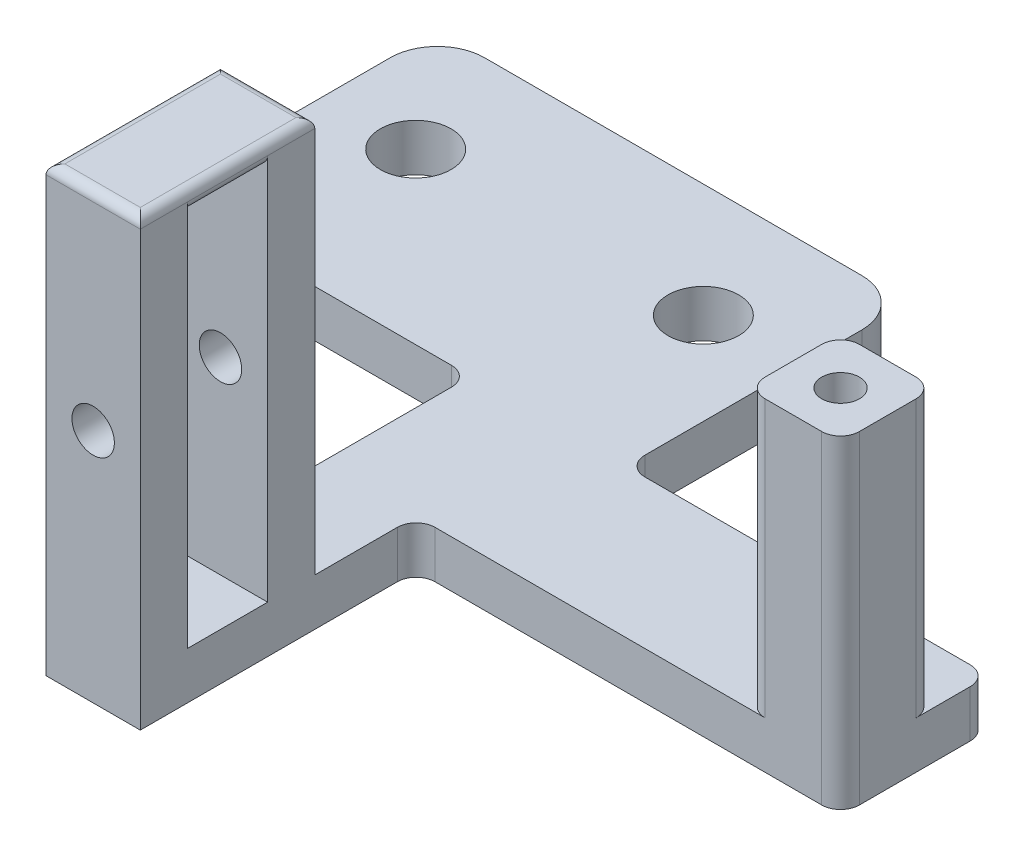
ISO-10303-21;
HEADER;
FILE_DESCRIPTION(('STEP AP214'),'2;1');
FILE_NAME('part.step','',(''),(''),'','','');
FILE_SCHEMA(('AUTOMOTIVE_DESIGN { 1 0 10303 214 1 1 1 1 }'));
ENDSEC;
DATA;
#1=APPLICATION_CONTEXT('core data for automotive mechanical design processes');
#2=APPLICATION_PROTOCOL_DEFINITION('international standard','automotive_design',2000,#1);
#3=PRODUCT_CONTEXT('',#1,'mechanical');
#4=PRODUCT('Part','Part','',(#3));
#5=PRODUCT_RELATED_PRODUCT_CATEGORY('part','',(#4));
#6=PRODUCT_DEFINITION_FORMATION('','',#4);
#7=PRODUCT_DEFINITION_CONTEXT('part definition',#1,'design');
#8=PRODUCT_DEFINITION('design','',#6,#7);
#9=PRODUCT_DEFINITION_SHAPE('','',#8);
#10=(LENGTH_UNIT() NAMED_UNIT(*) SI_UNIT(.MILLI.,.METRE.));
#11=(NAMED_UNIT(*) PLANE_ANGLE_UNIT() SI_UNIT($,.RADIAN.));
#12=(NAMED_UNIT(*) SI_UNIT($,.STERADIAN.) SOLID_ANGLE_UNIT());
#13=UNCERTAINTY_MEASURE_WITH_UNIT(LENGTH_MEASURE(1.E-05),#10,'distance_accuracy_value','');
#14=(GEOMETRIC_REPRESENTATION_CONTEXT(3) GLOBAL_UNCERTAINTY_ASSIGNED_CONTEXT((#13)) GLOBAL_UNIT_ASSIGNED_CONTEXT((#10,
#11,#12)) REPRESENTATION_CONTEXT('',''));
#15=CARTESIAN_POINT('',(0.,0.,0.));
#16=DIRECTION('',(0.,0.,1.));
#17=DIRECTION('',(1.,0.,0.));
#18=AXIS2_PLACEMENT_3D('',#15,#16,#17);
#19=CARTESIAN_POINT('',(33.5,30.,-5.));
#20=DIRECTION('',(0.,0.,1.));
#21=DIRECTION('',(1.,0.,0.));
#22=AXIS2_PLACEMENT_3D('',#19,#20,#21);
#23=PLANE('',#22);
#24=CARTESIAN_POINT('',(38.5,25.,-5.));
#25=DIRECTION('',(0.,0.,1.));
#26=DIRECTION('',(1.,0.,0.));
#27=AXIS2_PLACEMENT_3D('',#24,#25,#26);
#28=CIRCLE('',#27,2.25);
#29=CARTESIAN_POINT('',(40.75,25.,-5.));
#30=VERTEX_POINT('',#29);
#31=EDGE_CURVE('E537',#30,#30,#28,.T.);
#32=ORIENTED_EDGE('',*,*,#31,.T.);
#33=EDGE_LOOP('',(#32));
#34=FACE_BOUND('',#33,.T.);
#35=DIRECTION('',(0.,-1.,0.));
#36=VECTOR('',#35,1.);
#37=CARTESIAN_POINT('',(33.5,30.,-5.));
#38=LINE('',#37,#36);
#39=CARTESIAN_POINT('',(33.5,46.,-5.));
#40=VERTEX_POINT('',#39);
#41=CARTESIAN_POINT('',(33.5,5.,-5.));
#42=VERTEX_POINT('',#41);
#43=EDGE_CURVE('E435',#40,#42,#38,.T.);
#44=ORIENTED_EDGE('',*,*,#43,.F.);
#45=CARTESIAN_POINT('',(34.5,46.,-5.));
#46=DIRECTION('',(0.,0.,1.));
#47=DIRECTION('',(1.,0.,0.));
#48=AXIS2_PLACEMENT_3D('',#45,#46,#47);
#49=CIRCLE('',#48,1.);
#50=CARTESIAN_POINT('',(34.5,45.,-5.));
#51=VERTEX_POINT('',#50);
#52=EDGE_CURVE('E11',#40,#51,#49,.T.);
#53=ORIENTED_EDGE('',*,*,#52,.T.);
#54=DIRECTION('',(1.,0.,0.));
#55=VECTOR('',#54,1.);
#56=CARTESIAN_POINT('',(33.5,45.,-5.));
#57=LINE('',#56,#55);
#58=CARTESIAN_POINT('',(42.5,45.,-5.));
#59=VERTEX_POINT('',#58);
#60=EDGE_CURVE('E292',#51,#59,#57,.T.);
#61=ORIENTED_EDGE('',*,*,#60,.T.);
#62=CARTESIAN_POINT('',(42.5,46.,-5.));
#63=DIRECTION('',(0.,0.,1.));
#64=DIRECTION('',(1.,0.,0.));
#65=AXIS2_PLACEMENT_3D('',#62,#63,#64);
#66=CIRCLE('',#65,1.);
#67=CARTESIAN_POINT('',(43.5,46.,-5.));
#68=VERTEX_POINT('',#67);
#69=EDGE_CURVE('E529',#59,#68,#66,.T.);
#70=ORIENTED_EDGE('',*,*,#69,.T.);
#71=DIRECTION('',(0.,-1.,0.));
#72=VECTOR('',#71,1.);
#73=CARTESIAN_POINT('',(43.5,30.,-5.));
#74=LINE('',#73,#72);
#75=CARTESIAN_POINT('',(43.5,5.,-5.));
#76=VERTEX_POINT('',#75);
#77=EDGE_CURVE('E437',#68,#76,#74,.T.);
#78=ORIENTED_EDGE('',*,*,#77,.T.);
#79=DIRECTION('',(-1.,0.,0.));
#80=VECTOR('',#79,1.);
#81=CARTESIAN_POINT('',(33.5,5.,-5.));
#82=LINE('',#81,#80);
#83=EDGE_CURVE('E432',#76,#42,#82,.T.);
#84=ORIENTED_EDGE('',*,*,#83,.T.);
#85=EDGE_LOOP('',(#44,#53,#61,#70,#78,#84));
#86=FACE_BOUND('',#85,.T.);
#87=ADVANCED_FACE('F33',(#34,#86),#23,.F.);
#88=CARTESIAN_POINT('',(33.5,30.,-13.5));
#89=DIRECTION('',(0.,0.,-1.));
#90=DIRECTION('',(-1.,0.,0.));
#91=AXIS2_PLACEMENT_3D('',#88,#89,#90);
#92=PLANE('',#91);
#93=CARTESIAN_POINT('',(38.5,25.,-13.5));
#94=DIRECTION('',(0.,0.,-1.));
#95=DIRECTION('',(-1.,0.,0.));
#96=AXIS2_PLACEMENT_3D('',#93,#94,#95);
#97=CIRCLE('',#96,2.25);
#98=CARTESIAN_POINT('',(36.25,25.,-13.5));
#99=VERTEX_POINT('',#98);
#100=EDGE_CURVE('E561',#99,#99,#97,.T.);
#101=ORIENTED_EDGE('',*,*,#100,.T.);
#102=EDGE_LOOP('',(#101));
#103=FACE_BOUND('',#102,.T.);
#104=DIRECTION('',(1.,0.,0.));
#105=VECTOR('',#104,1.);
#106=CARTESIAN_POINT('',(33.5,45.,-13.5));
#107=LINE('',#106,#105);
#108=CARTESIAN_POINT('',(34.5,45.,-13.5));
#109=VERTEX_POINT('',#108);
#110=CARTESIAN_POINT('',(42.5,45.,-13.5));
#111=VERTEX_POINT('',#110);
#112=EDGE_CURVE('E502',#109,#111,#107,.T.);
#113=ORIENTED_EDGE('',*,*,#112,.F.);
#114=CARTESIAN_POINT('',(34.5,46.,-13.5));
#115=DIRECTION('',(0.,0.,-1.));
#116=DIRECTION('',(-1.,0.,0.));
#117=AXIS2_PLACEMENT_3D('',#114,#115,#116);
#118=CIRCLE('',#117,1.);
#119=CARTESIAN_POINT('',(33.5,46.,-13.5));
#120=VERTEX_POINT('',#119);
#121=EDGE_CURVE('E42',#109,#120,#118,.T.);
#122=ORIENTED_EDGE('',*,*,#121,.T.);
#123=DIRECTION('',(0.,-1.,0.));
#124=VECTOR('',#123,1.);
#125=CARTESIAN_POINT('',(33.5,30.,-13.5));
#126=LINE('',#125,#124);
#127=CARTESIAN_POINT('',(33.5,5.,-13.5));
#128=VERTEX_POINT('',#127);
#129=EDGE_CURVE('E428',#120,#128,#126,.T.);
#130=ORIENTED_EDGE('',*,*,#129,.T.);
#131=DIRECTION('',(1.,0.,0.));
#132=VECTOR('',#131,1.);
#133=CARTESIAN_POINT('',(33.5,5.,-13.5));
#134=LINE('',#133,#132);
#135=CARTESIAN_POINT('',(43.5,5.,-13.5));
#136=VERTEX_POINT('',#135);
#137=EDGE_CURVE('E421',#128,#136,#134,.T.);
#138=ORIENTED_EDGE('',*,*,#137,.T.);
#139=DIRECTION('',(0.,-1.,0.));
#140=VECTOR('',#139,1.);
#141=CARTESIAN_POINT('',(43.5,30.,-13.5));
#142=LINE('',#141,#140);
#143=CARTESIAN_POINT('',(43.5,46.,-13.5));
#144=VERTEX_POINT('',#143);
#145=EDGE_CURVE('E426',#144,#136,#142,.T.);
#146=ORIENTED_EDGE('',*,*,#145,.F.);
#147=CARTESIAN_POINT('',(42.5,46.,-13.5));
#148=DIRECTION('',(0.,0.,-1.));
#149=DIRECTION('',(-1.,0.,0.));
#150=AXIS2_PLACEMENT_3D('',#147,#148,#149);
#151=CIRCLE('',#150,1.);
#152=EDGE_CURVE('E50',#144,#111,#151,.T.);
#153=ORIENTED_EDGE('',*,*,#152,.T.);
#154=EDGE_LOOP('',(#113,#122,#130,#138,#146,#153));
#155=FACE_BOUND('',#154,.T.);
#156=ADVANCED_FACE('F582',(#103,#155),#92,.F.);
#157=CARTESIAN_POINT('',(0.,5.,0.));
#158=DIRECTION('',(0.,-1.,0.));
#159=DIRECTION('',(0.,0.,-1.));
#160=AXIS2_PLACEMENT_3D('',#157,#158,#159);
#161=PLANE('',#160);
#162=DIRECTION('',(0.,0.,1.));
#163=VECTOR('',#162,1.);
#164=CARTESIAN_POINT('',(43.5,5.,0.));
#165=LINE('',#164,#163);
#166=EDGE_CURVE('E338',#136,#76,#165,.T.);
#167=ORIENTED_EDGE('',*,*,#166,.F.);
#168=ORIENTED_EDGE('',*,*,#137,.F.);
#169=DIRECTION('',(0.,0.,1.));
#170=VECTOR('',#169,1.);
#171=CARTESIAN_POINT('',(33.5,5.,0.));
#172=LINE('',#171,#170);
#173=EDGE_CURVE('E342',#128,#42,#172,.T.);
#174=ORIENTED_EDGE('',*,*,#173,.T.);
#175=ORIENTED_EDGE('',*,*,#83,.F.);
#176=EDGE_LOOP('',(#167,#168,#174,#175));
#177=FACE_BOUND('',#176,.T.);
#178=ADVANCED_FACE('F584',(#177),#161,.F.);
#179=CARTESIAN_POINT('',(40.25,5.,-62.95));
#180=DIRECTION('',(0.,1.,0.));
#181=DIRECTION('',(0.,0.,1.));
#182=AXIS2_PLACEMENT_3D('',#179,#180,#181);
#183=CIRCLE('',#182,3.75000000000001);
#184=CARTESIAN_POINT('',(40.25,5.,-59.2));
#185=VERTEX_POINT('',#184);
#186=EDGE_CURVE('E444',#185,#185,#183,.T.);
#187=ORIENTED_EDGE('',*,*,#186,.F.);
#188=EDGE_LOOP('',(#187));
#189=FACE_BOUND('',#188,.T.);
#190=CARTESIAN_POINT('',(9.75,5.,-62.95));
#191=DIRECTION('',(0.,1.,0.));
#192=DIRECTION('',(0.,0.,1.));
#193=AXIS2_PLACEMENT_3D('',#190,#191,#192);
#194=CIRCLE('',#193,3.75);
#195=CARTESIAN_POINT('',(9.75,5.,-59.2));
#196=VERTEX_POINT('',#195);
#197=EDGE_CURVE('E450',#196,#196,#194,.T.);
#198=ORIENTED_EDGE('',*,*,#197,.F.);
#199=EDGE_LOOP('',(#198));
#200=FACE_BOUND('',#199,.T.);
#201=DIRECTION('',(0.,0.,-1.));
#202=VECTOR('',#201,1.);
#203=CARTESIAN_POINT('',(50.,5.,0.));
#204=LINE('',#203,#202);
#205=CARTESIAN_POINT('',(50.,5.,-47.));
#206=VERTEX_POINT('',#205);
#207=CARTESIAN_POINT('',(50.,5.,-70.));
#208=VERTEX_POINT('',#207);
#209=EDGE_CURVE('E346',#206,#208,#204,.T.);
#210=ORIENTED_EDGE('',*,*,#209,.T.);
#211=CARTESIAN_POINT('',(45.,5.,-70.));
#212=DIRECTION('',(0.,-1.,0.));
#213=DIRECTION('',(0.,0.,-1.));
#214=AXIS2_PLACEMENT_3D('',#211,#212,#213);
#215=CIRCLE('',#214,5.);
#216=CARTESIAN_POINT('',(45.,5.,-75.));
#217=VERTEX_POINT('',#216);
#218=EDGE_CURVE('E479',#208,#217,#215,.F.);
#219=ORIENTED_EDGE('',*,*,#218,.T.);
#220=DIRECTION('',(-1.,0.,0.));
#221=VECTOR('',#220,1.);
#222=CARTESIAN_POINT('',(0.,5.,-75.));
#223=LINE('',#222,#221);
#224=CARTESIAN_POINT('',(5.,5.,-75.));
#225=VERTEX_POINT('',#224);
#226=EDGE_CURVE('E459',#217,#225,#223,.T.);
#227=ORIENTED_EDGE('',*,*,#226,.T.);
#228=CARTESIAN_POINT('',(5.,5.,-70.));
#229=DIRECTION('',(0.,-1.,0.));
#230=DIRECTION('',(0.,0.,-1.));
#231=AXIS2_PLACEMENT_3D('',#228,#229,#230);
#232=CIRCLE('',#231,5.);
#233=CARTESIAN_POINT('',(0.,5.,-70.));
#234=VERTEX_POINT('',#233);
#235=EDGE_CURVE('E477',#225,#234,#232,.F.);
#236=ORIENTED_EDGE('',*,*,#235,.T.);
#237=DIRECTION('',(0.,0.,1.));
#238=VECTOR('',#237,1.);
#239=CARTESIAN_POINT('',(0.,5.,0.));
#240=LINE('',#239,#238);
#241=CARTESIAN_POINT('',(0.,5.,-50.));
#242=VERTEX_POINT('',#241);
#243=EDGE_CURVE('E456',#234,#242,#240,.T.);
#244=ORIENTED_EDGE('',*,*,#243,.T.);
#245=CARTESIAN_POINT('',(5.,5.,-50.));
#246=DIRECTION('',(0.,-1.,0.));
#247=DIRECTION('',(0.,0.,-1.));
#248=AXIS2_PLACEMENT_3D('',#245,#246,#247);
#249=CIRCLE('',#248,5.);
#250=CARTESIAN_POINT('',(5.,5.,-45.));
#251=VERTEX_POINT('',#250);
#252=EDGE_CURVE('E475',#242,#251,#249,.F.);
#253=ORIENTED_EDGE('',*,*,#252,.T.);
#254=DIRECTION('',(-1.,0.,0.));
#255=VECTOR('',#254,1.);
#256=CARTESIAN_POINT('',(0.,5.,-45.));
#257=LINE('',#256,#255);
#258=CARTESIAN_POINT('',(31.5,5.,-45.));
#259=VERTEX_POINT('',#258);
#260=EDGE_CURVE('E349',#259,#251,#257,.T.);
#261=ORIENTED_EDGE('',*,*,#260,.F.);
#262=CARTESIAN_POINT('',(31.5,5.,-43.));
#263=DIRECTION('',(0.,-1.,0.));
#264=DIRECTION('',(0.,0.,-1.));
#265=AXIS2_PLACEMENT_3D('',#262,#263,#264);
#266=CIRCLE('',#265,2.);
#267=CARTESIAN_POINT('',(33.5,5.,-43.));
#268=VERTEX_POINT('',#267);
#269=EDGE_CURVE('E352',#268,#259,#266,.F.);
#270=ORIENTED_EDGE('',*,*,#269,.F.);
#271=CARTESIAN_POINT('',(33.5,5.,-18.5));
#272=VERTEX_POINT('',#271);
#273=EDGE_CURVE('E345',#268,#272,#172,.T.);
#274=ORIENTED_EDGE('',*,*,#273,.T.);
#275=DIRECTION('',(-1.,0.,0.));
#276=VECTOR('',#275,1.);
#277=CARTESIAN_POINT('',(33.5,5.,-18.5));
#278=LINE('',#277,#276);
#279=CARTESIAN_POINT('',(43.5,5.,-18.5));
#280=VERTEX_POINT('',#279);
#281=EDGE_CURVE('E418',#280,#272,#278,.T.);
#282=ORIENTED_EDGE('',*,*,#281,.F.);
#283=CARTESIAN_POINT('',(43.5,5.,-27.25));
#284=VERTEX_POINT('',#283);
#285=EDGE_CURVE('E339',#284,#280,#165,.T.);
#286=ORIENTED_EDGE('',*,*,#285,.F.);
#287=CARTESIAN_POINT('',(45.5,5.,-27.25));
#288=DIRECTION('',(0.,-1.,0.));
#289=DIRECTION('',(0.,0.,-1.));
#290=AXIS2_PLACEMENT_3D('',#287,#288,#289);
#291=CIRCLE('',#290,2.);
#292=CARTESIAN_POINT('',(45.5,5.,-29.25));
#293=VERTEX_POINT('',#292);
#294=EDGE_CURVE('E354',#284,#293,#291,.T.);
#295=ORIENTED_EDGE('',*,*,#294,.T.);
#296=DIRECTION('',(1.,0.,0.));
#297=VECTOR('',#296,1.);
#298=CARTESIAN_POINT('',(0.,5.,-29.25));
#299=LINE('',#298,#297);
#300=CARTESIAN_POINT('',(80.5,5.,-29.25));
#301=VERTEX_POINT('',#300);
#302=EDGE_CURVE('E335',#293,#301,#299,.T.);
#303=ORIENTED_EDGE('',*,*,#302,.T.);
#304=CARTESIAN_POINT('',(80.5,5.,-31.25));
#305=DIRECTION('',(0.,1.,0.));
#306=DIRECTION('',(0.,0.,1.));
#307=AXIS2_PLACEMENT_3D('',#304,#305,#306);
#308=CIRCLE('',#307,2.00000000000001);
#309=CARTESIAN_POINT('',(78.5,5.,-31.25));
#310=VERTEX_POINT('',#309);
#311=EDGE_CURVE('E393',#310,#301,#308,.T.);
#312=ORIENTED_EDGE('',*,*,#311,.F.);
#313=DIRECTION('',(0.,0.,1.));
#314=VECTOR('',#313,1.);
#315=CARTESIAN_POINT('',(78.5,5.,-37.25));
#316=LINE('',#315,#314);
#317=CARTESIAN_POINT('',(78.5,5.,-37.25));
#318=VERTEX_POINT('',#317);
#319=EDGE_CURVE('E390',#318,#310,#316,.T.);
#320=ORIENTED_EDGE('',*,*,#319,.F.);
#321=CARTESIAN_POINT('',(80.5,5.,-37.25));
#322=DIRECTION('',(0.,1.,0.));
#323=DIRECTION('',(0.,0.,1.));
#324=AXIS2_PLACEMENT_3D('',#321,#322,#323);
#325=CIRCLE('',#324,2.00000000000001);
#326=CARTESIAN_POINT('',(80.5,5.,-39.25));
#327=VERTEX_POINT('',#326);
#328=EDGE_CURVE('E373',#327,#318,#325,.T.);
#329=ORIENTED_EDGE('',*,*,#328,.F.);
#330=DIRECTION('',(1.,0.,0.));
#331=VECTOR('',#330,1.);
#332=CARTESIAN_POINT('',(80.5,5.,-39.25));
#333=LINE('',#332,#331);
#334=CARTESIAN_POINT('',(86.5,5.,-39.25));
#335=VERTEX_POINT('',#334);
#336=EDGE_CURVE('E399',#327,#335,#333,.T.);
#337=ORIENTED_EDGE('',*,*,#336,.T.);
#338=CARTESIAN_POINT('',(86.5,5.,-37.25));
#339=DIRECTION('',(0.,-1.,0.));
#340=DIRECTION('',(0.,0.,-1.));
#341=AXIS2_PLACEMENT_3D('',#338,#339,#340);
#342=CIRCLE('',#341,2.);
#343=CARTESIAN_POINT('',(88.5,5.,-37.25));
#344=VERTEX_POINT('',#343);
#345=EDGE_CURVE('E396',#335,#344,#342,.T.);
#346=ORIENTED_EDGE('',*,*,#345,.T.);
#347=DIRECTION('',(0.,0.,-1.));
#348=VECTOR('',#347,1.);
#349=CARTESIAN_POINT('',(88.4999999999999,5.,1.04526316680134E-13));
#350=LINE('',#349,#348);
#351=CARTESIAN_POINT('',(88.5,5.,-43.));
#352=VERTEX_POINT('',#351);
#353=EDGE_CURVE('E312',#344,#352,#350,.T.);
#354=ORIENTED_EDGE('',*,*,#353,.T.);
#355=CARTESIAN_POINT('',(86.5,5.,-43.));
#356=DIRECTION('',(0.,-1.,0.));
#357=DIRECTION('',(0.,0.,-1.));
#358=AXIS2_PLACEMENT_3D('',#355,#356,#357);
#359=CIRCLE('',#358,2.);
#360=CARTESIAN_POINT('',(86.5,5.,-45.));
#361=VERTEX_POINT('',#360);
#362=EDGE_CURVE('E263',#361,#352,#359,.T.);
#363=ORIENTED_EDGE('',*,*,#362,.F.);
#364=DIRECTION('',(1.,0.,0.));
#365=VECTOR('',#364,1.);
#366=CARTESIAN_POINT('',(0.,5.,-45.));
#367=LINE('',#366,#365);
#368=CARTESIAN_POINT('',(52.,5.,-45.));
#369=VERTEX_POINT('',#368);
#370=EDGE_CURVE('E359',#369,#361,#367,.T.);
#371=ORIENTED_EDGE('',*,*,#370,.F.);
#372=CARTESIAN_POINT('',(52.,5.,-47.));
#373=DIRECTION('',(0.,-1.,0.));
#374=DIRECTION('',(0.,0.,-1.));
#375=AXIS2_PLACEMENT_3D('',#372,#373,#374);
#376=CIRCLE('',#375,2.);
#377=EDGE_CURVE('E357',#206,#369,#376,.F.);
#378=ORIENTED_EDGE('',*,*,#377,.F.);
#379=EDGE_LOOP('',(#210,#219,#227,#236,#244,#253,#261,#270,#274,#282,#286,#295,#303,#312,#320,
#329,#337,#346,#354,#363,#371,#378));
#380=FACE_BOUND('',#379,.T.);
#381=ADVANCED_FACE('F649',(#189,#200,#380),#161,.F.);
#382=CARTESIAN_POINT('',(0.,5.,0.));
#383=DIRECTION('',(1.,0.,0.));
#384=DIRECTION('',(0.,0.,-1.));
#385=AXIS2_PLACEMENT_3D('',#382,#383,#384);
#386=PLANE('',#385);
#387=ORIENTED_EDGE('',*,*,#243,.F.);
#388=DIRECTION('',(0.,-1.,0.));
#389=VECTOR('',#388,1.);
#390=CARTESIAN_POINT('',(0.,5.,-70.));
#391=LINE('',#390,#389);
#392=CARTESIAN_POINT('',(0.,0.,-70.));
#393=VERTEX_POINT('',#392);
#394=EDGE_CURVE('E494',#234,#393,#391,.T.);
#395=ORIENTED_EDGE('',*,*,#394,.T.);
#396=DIRECTION('',(0.,0.,1.));
#397=VECTOR('',#396,1.);
#398=CARTESIAN_POINT('',(0.,0.,0.));
#399=LINE('',#398,#397);
#400=CARTESIAN_POINT('',(0.,0.,-50.));
#401=VERTEX_POINT('',#400);
#402=EDGE_CURVE('E453',#393,#401,#399,.T.);
#403=ORIENTED_EDGE('',*,*,#402,.T.);
#404=DIRECTION('',(0.,1.,0.));
#405=VECTOR('',#404,1.);
#406=CARTESIAN_POINT('',(0.,5.,-50.));
#407=LINE('',#406,#405);
#408=EDGE_CURVE('E491',#401,#242,#407,.T.);
#409=ORIENTED_EDGE('',*,*,#408,.T.);
#410=EDGE_LOOP('',(#387,#395,#403,#409));
#411=FACE_BOUND('',#410,.T.);
#412=ADVANCED_FACE('F659',(#411),#386,.F.);
#413=CARTESIAN_POINT('',(0.,5.,0.));
#414=DIRECTION('',(0.,0.,-1.));
#415=DIRECTION('',(-1.,0.,0.));
#416=AXIS2_PLACEMENT_3D('',#413,#414,#415);
#417=PLANE('',#416);
#418=CARTESIAN_POINT('',(38.5,25.,0.));
#419=DIRECTION('',(0.,0.,1.));
#420=DIRECTION('',(1.,0.,0.));
#421=AXIS2_PLACEMENT_3D('',#418,#419,#420);
#422=CIRCLE('',#421,2.25);
#423=CARTESIAN_POINT('',(40.75,25.,0.));
#424=VERTEX_POINT('',#423);
#425=EDGE_CURVE('E564',#424,#424,#422,.T.);
#426=ORIENTED_EDGE('',*,*,#425,.F.);
#427=EDGE_LOOP('',(#426));
#428=FACE_BOUND('',#427,.T.);
#429=DIRECTION('',(0.,-1.,0.));
#430=VECTOR('',#429,1.);
#431=CARTESIAN_POINT('',(43.5,30.,0.));
#432=LINE('',#431,#430);
#433=CARTESIAN_POINT('',(43.5,46.,0.));
#434=VERTEX_POINT('',#433);
#435=CARTESIAN_POINT('',(43.5,0.,0.));
#436=VERTEX_POINT('',#435);
#437=EDGE_CURVE('E439',#434,#436,#432,.T.);
#438=ORIENTED_EDGE('',*,*,#437,.F.);
#439=DIRECTION('',(1.,0.,0.));
#440=VECTOR('',#439,1.);
#441=CARTESIAN_POINT('',(33.5,46.,0.));
#442=LINE('',#441,#440);
#443=CARTESIAN_POINT('',(33.5,46.,0.));
#444=VERTEX_POINT('',#443);
#445=EDGE_CURVE('E523',#434,#444,#442,.F.);
#446=ORIENTED_EDGE('',*,*,#445,.T.);
#447=DIRECTION('',(0.,-1.,0.));
#448=VECTOR('',#447,1.);
#449=CARTESIAN_POINT('',(33.5,30.,0.));
#450=LINE('',#449,#448);
#451=CARTESIAN_POINT('',(33.5,0.,0.));
#452=VERTEX_POINT('',#451);
#453=EDGE_CURVE('E441',#444,#452,#450,.T.);
#454=ORIENTED_EDGE('',*,*,#453,.T.);
#455=DIRECTION('',(1.,0.,0.));
#456=VECTOR('',#455,1.);
#457=CARTESIAN_POINT('',(0.,0.,0.));
#458=LINE('',#457,#456);
#459=EDGE_CURVE('E466',#452,#436,#458,.T.);
#460=ORIENTED_EDGE('',*,*,#459,.T.);
#461=EDGE_LOOP('',(#438,#446,#454,#460));
#462=FACE_BOUND('',#461,.T.);
#463=ADVANCED_FACE('F653',(#428,#462),#417,.F.);
#464=CARTESIAN_POINT('',(0.,0.,0.));
#465=DIRECTION('',(0.,-1.,0.));
#466=DIRECTION('',(0.,0.,-1.));
#467=AXIS2_PLACEMENT_3D('',#464,#465,#466);
#468=PLANE('',#467);
#469=DIRECTION('',(-1.,0.,0.));
#470=VECTOR('',#469,1.);
#471=CARTESIAN_POINT('',(0.,0.,-75.));
#472=LINE('',#471,#470);
#473=CARTESIAN_POINT('',(45.,0.,-75.));
#474=VERTEX_POINT('',#473);
#475=CARTESIAN_POINT('',(5.,0.,-75.));
#476=VERTEX_POINT('',#475);
#477=EDGE_CURVE('E460',#474,#476,#472,.T.);
#478=ORIENTED_EDGE('',*,*,#477,.F.);
#479=CARTESIAN_POINT('',(45.,0.,-70.));
#480=DIRECTION('',(0.,-1.,0.));
#481=DIRECTION('',(0.,0.,-1.));
#482=AXIS2_PLACEMENT_3D('',#479,#480,#481);
#483=CIRCLE('',#482,5.);
#484=CARTESIAN_POINT('',(50.,0.,-70.));
#485=VERTEX_POINT('',#484);
#486=EDGE_CURVE('E489',#474,#485,#483,.T.);
#487=ORIENTED_EDGE('',*,*,#486,.T.);
#488=DIRECTION('',(0.,0.,1.));
#489=VECTOR('',#488,1.);
#490=CARTESIAN_POINT('',(50.,0.,0.));
#491=LINE('',#490,#489);
#492=CARTESIAN_POINT('',(50.,0.,-47.));
#493=VERTEX_POINT('',#492);
#494=EDGE_CURVE('E304',#485,#493,#491,.T.);
#495=ORIENTED_EDGE('',*,*,#494,.T.);
#496=CARTESIAN_POINT('',(52.,0.,-47.));
#497=DIRECTION('',(0.,1.,0.));
#498=DIRECTION('',(0.,0.,1.));
#499=AXIS2_PLACEMENT_3D('',#496,#497,#498);
#500=CIRCLE('',#499,2.);
#501=CARTESIAN_POINT('',(52.,0.,-45.));
#502=VERTEX_POINT('',#501);
#503=EDGE_CURVE('E306',#502,#493,#500,.F.);
#504=ORIENTED_EDGE('',*,*,#503,.F.);
#505=DIRECTION('',(-1.,0.,0.));
#506=VECTOR('',#505,1.);
#507=CARTESIAN_POINT('',(0.,0.,-45.));
#508=LINE('',#507,#506);
#509=CARTESIAN_POINT('',(86.5,0.,-45.));
#510=VERTEX_POINT('',#509);
#511=EDGE_CURVE('E268',#510,#502,#508,.T.);
#512=ORIENTED_EDGE('',*,*,#511,.F.);
#513=CARTESIAN_POINT('',(86.5,0.,-43.));
#514=DIRECTION('',(0.,1.,0.));
#515=DIRECTION('',(0.,0.,1.));
#516=AXIS2_PLACEMENT_3D('',#513,#514,#515);
#517=CIRCLE('',#516,2.);
#518=CARTESIAN_POINT('',(88.5,0.,-43.));
#519=VERTEX_POINT('',#518);
#520=EDGE_CURVE('E260',#519,#510,#517,.T.);
#521=ORIENTED_EDGE('',*,*,#520,.F.);
#522=DIRECTION('',(0.,0.,1.));
#523=VECTOR('',#522,1.);
#524=CARTESIAN_POINT('',(88.4999999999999,0.,1.04526316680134E-13));
#525=LINE('',#524,#523);
#526=CARTESIAN_POINT('',(88.5,0.,-31.25));
#527=VERTEX_POINT('',#526);
#528=EDGE_CURVE('E271',#519,#527,#525,.T.);
#529=ORIENTED_EDGE('',*,*,#528,.T.);
#530=CARTESIAN_POINT('',(86.5,0.,-31.25));
#531=DIRECTION('',(0.,1.,0.));
#532=DIRECTION('',(0.,0.,1.));
#533=AXIS2_PLACEMENT_3D('',#530,#531,#532);
#534=CIRCLE('',#533,1.99999999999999);
#535=CARTESIAN_POINT('',(86.5,0.,-29.25));
#536=VERTEX_POINT('',#535);
#537=EDGE_CURVE('E279',#527,#536,#534,.F.);
#538=ORIENTED_EDGE('',*,*,#537,.T.);
#539=DIRECTION('',(-1.,0.,0.));
#540=VECTOR('',#539,1.);
#541=CARTESIAN_POINT('',(0.,0.,-29.25));
#542=LINE('',#541,#540);
#543=CARTESIAN_POINT('',(45.5,0.,-29.25));
#544=VERTEX_POINT('',#543);
#545=EDGE_CURVE('E296',#536,#544,#542,.T.);
#546=ORIENTED_EDGE('',*,*,#545,.T.);
#547=CARTESIAN_POINT('',(45.5,0.,-27.25));
#548=DIRECTION('',(0.,1.,0.));
#549=DIRECTION('',(0.,0.,1.));
#550=AXIS2_PLACEMENT_3D('',#547,#548,#549);
#551=CIRCLE('',#550,2.);
#552=CARTESIAN_POINT('',(43.5,0.,-27.25));
#553=VERTEX_POINT('',#552);
#554=EDGE_CURVE('E299',#544,#553,#551,.T.);
#555=ORIENTED_EDGE('',*,*,#554,.T.);
#556=DIRECTION('',(0.,0.,-1.));
#557=VECTOR('',#556,1.);
#558=CARTESIAN_POINT('',(43.5,0.,0.));
#559=LINE('',#558,#557);
#560=EDGE_CURVE('E302',#436,#553,#559,.T.);
#561=ORIENTED_EDGE('',*,*,#560,.F.);
#562=ORIENTED_EDGE('',*,*,#459,.F.);
#563=DIRECTION('',(0.,0.,-1.));
#564=VECTOR('',#563,1.);
#565=CARTESIAN_POINT('',(33.5,0.,0.));
#566=LINE('',#565,#564);
#567=CARTESIAN_POINT('',(33.5,0.,-43.));
#568=VERTEX_POINT('',#567);
#569=EDGE_CURVE('E330',#452,#568,#566,.T.);
#570=ORIENTED_EDGE('',*,*,#569,.T.);
#571=CARTESIAN_POINT('',(31.5,0.,-43.));
#572=DIRECTION('',(0.,1.,0.));
#573=DIRECTION('',(0.,0.,1.));
#574=AXIS2_PLACEMENT_3D('',#571,#572,#573);
#575=CIRCLE('',#574,2.);
#576=CARTESIAN_POINT('',(31.5,0.,-45.));
#577=VERTEX_POINT('',#576);
#578=EDGE_CURVE('E324',#577,#568,#575,.F.);
#579=ORIENTED_EDGE('',*,*,#578,.F.);
#580=DIRECTION('',(1.,0.,0.));
#581=VECTOR('',#580,1.);
#582=CARTESIAN_POINT('',(0.,0.,-45.));
#583=LINE('',#582,#581);
#584=CARTESIAN_POINT('',(5.,0.,-45.));
#585=VERTEX_POINT('',#584);
#586=EDGE_CURVE('E327',#585,#577,#583,.T.);
#587=ORIENTED_EDGE('',*,*,#586,.F.);
#588=CARTESIAN_POINT('',(5.,0.,-50.));
#589=DIRECTION('',(0.,-1.,0.));
#590=DIRECTION('',(0.,0.,-1.));
#591=AXIS2_PLACEMENT_3D('',#588,#589,#590);
#592=CIRCLE('',#591,5.);
#593=EDGE_CURVE('E485',#585,#401,#592,.T.);
#594=ORIENTED_EDGE('',*,*,#593,.T.);
#595=ORIENTED_EDGE('',*,*,#402,.F.);
#596=CARTESIAN_POINT('',(5.,0.,-70.));
#597=DIRECTION('',(0.,-1.,0.));
#598=DIRECTION('',(0.,0.,-1.));
#599=AXIS2_PLACEMENT_3D('',#596,#597,#598);
#600=CIRCLE('',#599,5.);
#601=EDGE_CURVE('E487',#393,#476,#600,.T.);
#602=ORIENTED_EDGE('',*,*,#601,.T.);
#603=EDGE_LOOP('',(#478,#487,#495,#504,#512,#521,#529,#538,#546,#555,#561,#562,#570,#579,#587,
#594,#595,#602));
#604=FACE_BOUND('',#603,.T.);
#605=CARTESIAN_POINT('',(83.5,0.,-34.25));
#606=DIRECTION('',(0.,-1.,0.));
#607=DIRECTION('',(0.,0.,-1.));
#608=AXIS2_PLACEMENT_3D('',#605,#606,#607);
#609=CIRCLE('',#608,3.50000000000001);
#610=CARTESIAN_POINT('',(83.5,0.,-37.75));
#611=VERTEX_POINT('',#610);
#612=EDGE_CURVE('E368',#611,#611,#609,.F.);
#613=ORIENTED_EDGE('',*,*,#612,.T.);
#614=EDGE_LOOP('',(#613));
#615=FACE_BOUND('',#614,.T.);
#616=CARTESIAN_POINT('',(9.75,0.,-62.95));
#617=DIRECTION('',(0.,1.,0.));
#618=DIRECTION('',(0.,0.,1.));
#619=AXIS2_PLACEMENT_3D('',#616,#617,#618);
#620=CIRCLE('',#619,3.75);
#621=CARTESIAN_POINT('',(9.75,0.,-59.2));
#622=VERTEX_POINT('',#621);
#623=EDGE_CURVE('E447',#622,#622,#620,.T.);
#624=ORIENTED_EDGE('',*,*,#623,.T.);
#625=EDGE_LOOP('',(#624));
#626=FACE_BOUND('',#625,.T.);
#627=CARTESIAN_POINT('',(40.25,0.,-62.95));
#628=DIRECTION('',(0.,1.,0.));
#629=DIRECTION('',(0.,0.,1.));
#630=AXIS2_PLACEMENT_3D('',#627,#628,#629);
#631=CIRCLE('',#630,3.75000000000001);
#632=CARTESIAN_POINT('',(40.25,0.,-59.2));
#633=VERTEX_POINT('',#632);
#634=EDGE_CURVE('E443',#633,#633,#631,.T.);
#635=ORIENTED_EDGE('',*,*,#634,.T.);
#636=EDGE_LOOP('',(#635));
#637=FACE_BOUND('',#636,.T.);
#638=ADVANCED_FACE('F283',(#604,#615,#626,#637),#468,.T.);
#639=CARTESIAN_POINT('',(0.,5.,-75.));
#640=DIRECTION('',(0.,0.,1.));
#641=DIRECTION('',(1.,0.,0.));
#642=AXIS2_PLACEMENT_3D('',#639,#640,#641);
#643=PLANE('',#642);
#644=ORIENTED_EDGE('',*,*,#226,.F.);
#645=DIRECTION('',(0.,1.,0.));
#646=VECTOR('',#645,1.);
#647=CARTESIAN_POINT('',(45.,5.,-75.));
#648=LINE('',#647,#646);
#649=EDGE_CURVE('E483',#217,#474,#648,.F.);
#650=ORIENTED_EDGE('',*,*,#649,.T.);
#651=ORIENTED_EDGE('',*,*,#477,.T.);
#652=DIRECTION('',(0.,-1.,0.));
#653=VECTOR('',#652,1.);
#654=CARTESIAN_POINT('',(5.,5.,-75.));
#655=LINE('',#654,#653);
#656=EDGE_CURVE('E481',#476,#225,#655,.F.);
#657=ORIENTED_EDGE('',*,*,#656,.T.);
#658=EDGE_LOOP('',(#644,#650,#651,#657));
#659=FACE_BOUND('',#658,.T.);
#660=ADVANCED_FACE('F645',(#659),#643,.F.);
#661=CARTESIAN_POINT('',(9.75,5.,-62.95));
#662=DIRECTION('',(0.,-1.,0.));
#663=DIRECTION('',(0.,0.,-1.));
#664=AXIS2_PLACEMENT_3D('',#661,#662,#663);
#665=CYLINDRICAL_SURFACE('',#664,3.75);
#666=ORIENTED_EDGE('',*,*,#197,.T.);
#667=EDGE_LOOP('',(#666));
#668=FACE_BOUND('',#667,.T.);
#669=ORIENTED_EDGE('',*,*,#623,.F.);
#670=EDGE_LOOP('',(#669));
#671=FACE_BOUND('',#670,.T.);
#672=ADVANCED_FACE('F641',(#668,#671),#665,.F.);
#673=CARTESIAN_POINT('',(40.25,5.,-62.95));
#674=DIRECTION('',(0.,-1.,0.));
#675=DIRECTION('',(0.,0.,-1.));
#676=AXIS2_PLACEMENT_3D('',#673,#674,#675);
#677=CYLINDRICAL_SURFACE('',#676,3.75000000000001);
#678=ORIENTED_EDGE('',*,*,#186,.T.);
#679=EDGE_LOOP('',(#678));
#680=FACE_BOUND('',#679,.T.);
#681=ORIENTED_EDGE('',*,*,#634,.F.);
#682=EDGE_LOOP('',(#681));
#683=FACE_BOUND('',#682,.T.);
#684=ADVANCED_FACE('F638',(#680,#683),#677,.F.);
#685=CARTESIAN_POINT('',(33.5,30.,0.));
#686=DIRECTION('',(1.,0.,0.));
#687=DIRECTION('',(0.,0.,-1.));
#688=AXIS2_PLACEMENT_3D('',#685,#686,#687);
#689=PLANE('',#688);
#690=ORIENTED_EDGE('',*,*,#129,.F.);
#691=DIRECTION('',(0.,0.,1.));
#692=VECTOR('',#691,1.);
#693=CARTESIAN_POINT('',(33.5,46.,-18.5));
#694=LINE('',#693,#692);
#695=CARTESIAN_POINT('',(33.5,46.,-18.5));
#696=VERTEX_POINT('',#695);
#697=EDGE_CURVE('E514',#120,#696,#694,.F.);
#698=ORIENTED_EDGE('',*,*,#697,.T.);
#699=DIRECTION('',(0.,-1.,0.));
#700=VECTOR('',#699,1.);
#701=CARTESIAN_POINT('',(33.5,30.,-18.5));
#702=LINE('',#701,#700);
#703=EDGE_CURVE('E430',#696,#272,#702,.T.);
#704=ORIENTED_EDGE('',*,*,#703,.T.);
#705=ORIENTED_EDGE('',*,*,#273,.F.);
#706=DIRECTION('',(0.,1.,0.));
#707=VECTOR('',#706,1.);
#708=CARTESIAN_POINT('',(33.5,0.,-43.));
#709=LINE('',#708,#707);
#710=EDGE_CURVE('E286',#568,#268,#709,.T.);
#711=ORIENTED_EDGE('',*,*,#710,.F.);
#712=ORIENTED_EDGE('',*,*,#569,.F.);
#713=ORIENTED_EDGE('',*,*,#453,.F.);
#714=DIRECTION('',(0.,0.,1.));
#715=VECTOR('',#714,1.);
#716=CARTESIAN_POINT('',(33.5,46.,-18.5));
#717=LINE('',#716,#715);
#718=EDGE_CURVE('E511',#444,#40,#717,.F.);
#719=ORIENTED_EDGE('',*,*,#718,.T.);
#720=ORIENTED_EDGE('',*,*,#43,.T.);
#721=ORIENTED_EDGE('',*,*,#173,.F.);
#722=EDGE_LOOP('',(#690,#698,#704,#705,#711,#712,#713,#719,#720,#721));
#723=FACE_BOUND('',#722,.T.);
#724=ADVANCED_FACE('F598',(#723),#689,.F.);
#725=CARTESIAN_POINT('',(43.5,30.,0.));
#726=DIRECTION('',(-1.,0.,0.));
#727=DIRECTION('',(0.,0.,1.));
#728=AXIS2_PLACEMENT_3D('',#725,#726,#727);
#729=PLANE('',#728);
#730=DIRECTION('',(0.,-1.,0.));
#731=VECTOR('',#730,1.);
#732=CARTESIAN_POINT('',(43.5,30.,-18.5));
#733=LINE('',#732,#731);
#734=CARTESIAN_POINT('',(43.5,46.,-18.5));
#735=VERTEX_POINT('',#734);
#736=EDGE_CURVE('E424',#735,#280,#733,.T.);
#737=ORIENTED_EDGE('',*,*,#736,.F.);
#738=DIRECTION('',(0.,0.,-1.));
#739=VECTOR('',#738,1.);
#740=CARTESIAN_POINT('',(43.5,46.,0.));
#741=LINE('',#740,#739);
#742=EDGE_CURVE('E520',#735,#144,#741,.F.);
#743=ORIENTED_EDGE('',*,*,#742,.T.);
#744=ORIENTED_EDGE('',*,*,#145,.T.);
#745=ORIENTED_EDGE('',*,*,#166,.T.);
#746=ORIENTED_EDGE('',*,*,#77,.F.);
#747=DIRECTION('',(0.,0.,-1.));
#748=VECTOR('',#747,1.);
#749=CARTESIAN_POINT('',(43.5,46.,0.));
#750=LINE('',#749,#748);
#751=EDGE_CURVE('E518',#68,#434,#750,.F.);
#752=ORIENTED_EDGE('',*,*,#751,.T.);
#753=ORIENTED_EDGE('',*,*,#437,.T.);
#754=ORIENTED_EDGE('',*,*,#560,.T.);
#755=DIRECTION('',(0.,1.,0.));
#756=VECTOR('',#755,1.);
#757=CARTESIAN_POINT('',(43.5,0.,-27.25));
#758=LINE('',#757,#756);
#759=EDGE_CURVE('E319',#553,#284,#758,.T.);
#760=ORIENTED_EDGE('',*,*,#759,.T.);
#761=ORIENTED_EDGE('',*,*,#285,.T.);
#762=EDGE_LOOP('',(#737,#743,#744,#745,#746,#752,#753,#754,#760,#761));
#763=FACE_BOUND('',#762,.T.);
#764=ADVANCED_FACE('F612',(#763),#729,.F.);
#765=CARTESIAN_POINT('',(33.5,30.,-18.5));
#766=DIRECTION('',(0.,0.,1.));
#767=DIRECTION('',(1.,0.,0.));
#768=AXIS2_PLACEMENT_3D('',#765,#766,#767);
#769=PLANE('',#768);
#770=CARTESIAN_POINT('',(38.5,25.,-18.5));
#771=DIRECTION('',(0.,0.,1.));
#772=DIRECTION('',(1.,0.,0.));
#773=AXIS2_PLACEMENT_3D('',#770,#771,#772);
#774=CIRCLE('',#773,2.25);
#775=CARTESIAN_POINT('',(40.75,25.,-18.5));
#776=VERTEX_POINT('',#775);
#777=EDGE_CURVE('E37',#776,#776,#774,.T.);
#778=ORIENTED_EDGE('',*,*,#777,.T.);
#779=EDGE_LOOP('',(#778));
#780=FACE_BOUND('',#779,.T.);
#781=ORIENTED_EDGE('',*,*,#703,.F.);
#782=DIRECTION('',(-1.,0.,0.));
#783=VECTOR('',#782,1.);
#784=CARTESIAN_POINT('',(43.5,46.,-18.5));
#785=LINE('',#784,#783);
#786=EDGE_CURVE('E516',#696,#735,#785,.F.);
#787=ORIENTED_EDGE('',*,*,#786,.T.);
#788=ORIENTED_EDGE('',*,*,#736,.T.);
#789=ORIENTED_EDGE('',*,*,#281,.T.);
#790=EDGE_LOOP('',(#781,#787,#788,#789));
#791=FACE_BOUND('',#790,.T.);
#792=ADVANCED_FACE('F571',(#780,#791),#769,.F.);
#793=CARTESIAN_POINT('',(78.5,34.3,-37.25));
#794=DIRECTION('',(1.,0.,0.));
#795=DIRECTION('',(0.,0.,-1.));
#796=AXIS2_PLACEMENT_3D('',#793,#794,#795);
#797=PLANE('',#796);
#798=DIRECTION('',(0.,-1.,0.));
#799=VECTOR('',#798,1.);
#800=CARTESIAN_POINT('',(78.5,34.3,-37.25));
#801=LINE('',#800,#799);
#802=CARTESIAN_POINT('',(78.5,34.3,-37.25));
#803=VERTEX_POINT('',#802);
#804=EDGE_CURVE('E389',#803,#318,#801,.T.);
#805=ORIENTED_EDGE('',*,*,#804,.T.);
#806=ORIENTED_EDGE('',*,*,#319,.T.);
#807=DIRECTION('',(0.,-1.,0.));
#808=VECTOR('',#807,1.);
#809=CARTESIAN_POINT('',(78.5,34.3,-31.25));
#810=LINE('',#809,#808);
#811=CARTESIAN_POINT('',(78.5,34.3,-31.25));
#812=VERTEX_POINT('',#811);
#813=EDGE_CURVE('E416',#812,#310,#810,.T.);
#814=ORIENTED_EDGE('',*,*,#813,.F.);
#815=DIRECTION('',(0.,0.,1.));
#816=VECTOR('',#815,1.);
#817=CARTESIAN_POINT('',(78.5,34.3,-37.25));
#818=LINE('',#817,#816);
#819=EDGE_CURVE('E369',#803,#812,#818,.T.);
#820=ORIENTED_EDGE('',*,*,#819,.F.);
#821=EDGE_LOOP('',(#805,#806,#814,#820));
#822=FACE_BOUND('',#821,.T.);
#823=ADVANCED_FACE('F881',(#822),#797,.F.);
#824=CARTESIAN_POINT('',(80.5,34.3,-31.25));
#825=DIRECTION('',(0.,-1.,0.));
#826=DIRECTION('',(0.,0.,-1.));
#827=AXIS2_PLACEMENT_3D('',#824,#825,#826);
#828=CYLINDRICAL_SURFACE('',#827,2.00000000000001);
#829=ORIENTED_EDGE('',*,*,#813,.T.);
#830=ORIENTED_EDGE('',*,*,#311,.T.);
#831=DIRECTION('',(0.,-1.,0.));
#832=VECTOR('',#831,1.);
#833=CARTESIAN_POINT('',(80.5,34.3,-29.25));
#834=LINE('',#833,#832);
#835=CARTESIAN_POINT('',(80.5,34.3,-29.25));
#836=VERTEX_POINT('',#835);
#837=EDGE_CURVE('E414',#836,#301,#834,.T.);
#838=ORIENTED_EDGE('',*,*,#837,.F.);
#839=CARTESIAN_POINT('',(80.5,34.3,-31.25));
#840=DIRECTION('',(0.,1.,0.));
#841=DIRECTION('',(0.,0.,1.));
#842=AXIS2_PLACEMENT_3D('',#839,#840,#841);
#843=CIRCLE('',#842,2.00000000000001);
#844=EDGE_CURVE('E372',#812,#836,#843,.T.);
#845=ORIENTED_EDGE('',*,*,#844,.F.);
#846=EDGE_LOOP('',(#829,#830,#838,#845));
#847=FACE_BOUND('',#846,.T.);
#848=ADVANCED_FACE('F870',(#847),#828,.T.);
#849=CARTESIAN_POINT('',(80.5,34.3,-29.25));
#850=DIRECTION('',(0.,0.,-1.));
#851=DIRECTION('',(-1.,0.,0.));
#852=AXIS2_PLACEMENT_3D('',#849,#850,#851);
#853=PLANE('',#852);
#854=ORIENTED_EDGE('',*,*,#837,.T.);
#855=ORIENTED_EDGE('',*,*,#302,.F.);
#856=DIRECTION('',(0.,1.,0.));
#857=VECTOR('',#856,1.);
#858=CARTESIAN_POINT('',(45.5,0.,-29.25));
#859=LINE('',#858,#857);
#860=EDGE_CURVE('E267',#544,#293,#859,.T.);
#861=ORIENTED_EDGE('',*,*,#860,.F.);
#862=ORIENTED_EDGE('',*,*,#545,.F.);
#863=DIRECTION('',(0.,-1.,0.));
#864=VECTOR('',#863,1.);
#865=CARTESIAN_POINT('',(86.5,34.3,-29.25));
#866=LINE('',#865,#864);
#867=CARTESIAN_POINT('',(86.5,34.3,-29.25));
#868=VERTEX_POINT('',#867);
#869=EDGE_CURVE('E412',#868,#536,#866,.T.);
#870=ORIENTED_EDGE('',*,*,#869,.F.);
#871=DIRECTION('',(1.,0.,0.));
#872=VECTOR('',#871,1.);
#873=CARTESIAN_POINT('',(80.5,34.3,-29.25));
#874=LINE('',#873,#872);
#875=EDGE_CURVE('E375',#836,#868,#874,.T.);
#876=ORIENTED_EDGE('',*,*,#875,.F.);
#877=EDGE_LOOP('',(#854,#855,#861,#862,#870,#876));
#878=FACE_BOUND('',#877,.T.);
#879=ADVANCED_FACE('F858',(#878),#853,.F.);
#880=CARTESIAN_POINT('',(86.5,34.3,-31.25));
#881=DIRECTION('',(0.,-1.,0.));
#882=DIRECTION('',(0.,0.,-1.));
#883=AXIS2_PLACEMENT_3D('',#880,#881,#882);
#884=CYLINDRICAL_SURFACE('',#883,1.99999999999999);
#885=ORIENTED_EDGE('',*,*,#869,.T.);
#886=ORIENTED_EDGE('',*,*,#537,.F.);
#887=DIRECTION('',(0.,-1.,0.));
#888=VECTOR('',#887,1.);
#889=CARTESIAN_POINT('',(88.5,34.3,-31.25));
#890=LINE('',#889,#888);
#891=CARTESIAN_POINT('',(88.5,34.3,-31.25));
#892=VERTEX_POINT('',#891);
#893=EDGE_CURVE('E275',#892,#527,#890,.T.);
#894=ORIENTED_EDGE('',*,*,#893,.F.);
#895=CARTESIAN_POINT('',(86.5,34.3,-31.25));
#896=DIRECTION('',(0.,1.,0.));
#897=DIRECTION('',(0.,0.,1.));
#898=AXIS2_PLACEMENT_3D('',#895,#896,#897);
#899=CIRCLE('',#898,1.99999999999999);
#900=EDGE_CURVE('E377',#868,#892,#899,.T.);
#901=ORIENTED_EDGE('',*,*,#900,.F.);
#902=EDGE_LOOP('',(#885,#886,#894,#901));
#903=FACE_BOUND('',#902,.T.);
#904=ADVANCED_FACE('F847',(#903),#884,.T.);
#905=CARTESIAN_POINT('',(88.5,34.3,-37.25));
#906=DIRECTION('',(1.,0.,0.));
#907=DIRECTION('',(0.,0.,-1.));
#908=AXIS2_PLACEMENT_3D('',#905,#906,#907);
#909=PLANE('',#908);
#910=ORIENTED_EDGE('',*,*,#893,.T.);
#911=ORIENTED_EDGE('',*,*,#528,.F.);
#912=DIRECTION('',(0.,1.,0.));
#913=VECTOR('',#912,1.);
#914=CARTESIAN_POINT('',(88.5,0.,-43.));
#915=LINE('',#914,#913);
#916=EDGE_CURVE('E255',#519,#352,#915,.T.);
#917=ORIENTED_EDGE('',*,*,#916,.T.);
#918=ORIENTED_EDGE('',*,*,#353,.F.);
#919=DIRECTION('',(0.,-1.,0.));
#920=VECTOR('',#919,1.);
#921=CARTESIAN_POINT('',(88.5,34.3,-37.25));
#922=LINE('',#921,#920);
#923=CARTESIAN_POINT('',(88.5,34.3,-37.25));
#924=VERTEX_POINT('',#923);
#925=EDGE_CURVE('E409',#924,#344,#922,.T.);
#926=ORIENTED_EDGE('',*,*,#925,.F.);
#927=DIRECTION('',(0.,0.,1.));
#928=VECTOR('',#927,1.);
#929=CARTESIAN_POINT('',(88.5,34.3,-37.25));
#930=LINE('',#929,#928);
#931=EDGE_CURVE('E379',#924,#892,#930,.T.);
#932=ORIENTED_EDGE('',*,*,#931,.T.);
#933=EDGE_LOOP('',(#910,#911,#917,#918,#926,#932));
#934=FACE_BOUND('',#933,.T.);
#935=ADVANCED_FACE('F272',(#934),#909,.T.);
#936=CARTESIAN_POINT('',(86.5,34.3,-37.25));
#937=DIRECTION('',(0.,-1.,0.));
#938=DIRECTION('',(0.,0.,-1.));
#939=AXIS2_PLACEMENT_3D('',#936,#937,#938);
#940=CYLINDRICAL_SURFACE('',#939,2.);
#941=ORIENTED_EDGE('',*,*,#925,.T.);
#942=ORIENTED_EDGE('',*,*,#345,.F.);
#943=DIRECTION('',(0.,-1.,0.));
#944=VECTOR('',#943,1.);
#945=CARTESIAN_POINT('',(86.5,34.3,-39.25));
#946=LINE('',#945,#944);
#947=CARTESIAN_POINT('',(86.5,34.3,-39.25));
#948=VERTEX_POINT('',#947);
#949=EDGE_CURVE('E407',#948,#335,#946,.T.);
#950=ORIENTED_EDGE('',*,*,#949,.F.);
#951=CARTESIAN_POINT('',(86.5,34.3,-37.25));
#952=DIRECTION('',(0.,-1.,0.));
#953=DIRECTION('',(0.,0.,-1.));
#954=AXIS2_PLACEMENT_3D('',#951,#952,#953);
#955=CIRCLE('',#954,2.);
#956=EDGE_CURVE('E381',#948,#924,#955,.T.);
#957=ORIENTED_EDGE('',*,*,#956,.T.);
#958=EDGE_LOOP('',(#941,#942,#950,#957));
#959=FACE_BOUND('',#958,.T.);
#960=ADVANCED_FACE('F827',(#959),#940,.T.);
#961=CARTESIAN_POINT('',(80.5,34.3,-39.25));
#962=DIRECTION('',(0.,0.,-1.));
#963=DIRECTION('',(-1.,0.,0.));
#964=AXIS2_PLACEMENT_3D('',#961,#962,#963);
#965=PLANE('',#964);
#966=ORIENTED_EDGE('',*,*,#949,.T.);
#967=ORIENTED_EDGE('',*,*,#336,.F.);
#968=DIRECTION('',(0.,-1.,0.));
#969=VECTOR('',#968,1.);
#970=CARTESIAN_POINT('',(80.5,34.3,-39.25));
#971=LINE('',#970,#969);
#972=CARTESIAN_POINT('',(80.5,34.3,-39.25));
#973=VERTEX_POINT('',#972);
#974=EDGE_CURVE('E405',#973,#327,#971,.T.);
#975=ORIENTED_EDGE('',*,*,#974,.F.);
#976=DIRECTION('',(1.,0.,0.));
#977=VECTOR('',#976,1.);
#978=CARTESIAN_POINT('',(80.5,34.3,-39.25));
#979=LINE('',#978,#977);
#980=EDGE_CURVE('E384',#973,#948,#979,.T.);
#981=ORIENTED_EDGE('',*,*,#980,.T.);
#982=EDGE_LOOP('',(#966,#967,#975,#981));
#983=FACE_BOUND('',#982,.T.);
#984=ADVANCED_FACE('F815',(#983),#965,.T.);
#985=CARTESIAN_POINT('',(80.5,34.3,-37.25));
#986=DIRECTION('',(0.,-1.,0.));
#987=DIRECTION('',(0.,0.,-1.));
#988=AXIS2_PLACEMENT_3D('',#985,#986,#987);
#989=CYLINDRICAL_SURFACE('',#988,2.00000000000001);
#990=ORIENTED_EDGE('',*,*,#974,.T.);
#991=ORIENTED_EDGE('',*,*,#328,.T.);
#992=ORIENTED_EDGE('',*,*,#804,.F.);
#993=CARTESIAN_POINT('',(80.5,34.3,-37.25));
#994=DIRECTION('',(0.,1.,0.));
#995=DIRECTION('',(0.,0.,1.));
#996=AXIS2_PLACEMENT_3D('',#993,#994,#995);
#997=CIRCLE('',#996,2.00000000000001);
#998=EDGE_CURVE('E387',#973,#803,#997,.T.);
#999=ORIENTED_EDGE('',*,*,#998,.F.);
#1000=EDGE_LOOP('',(#990,#991,#992,#999));
#1001=FACE_BOUND('',#1000,.T.);
#1002=ADVANCED_FACE('F809',(#1001),#989,.T.);
#1003=CARTESIAN_POINT('',(80.5,34.3,-31.25));
#1004=DIRECTION('',(0.,1.,0.));
#1005=DIRECTION('',(0.,0.,1.));
#1006=AXIS2_PLACEMENT_3D('',#1003,#1004,#1005);
#1007=PLANE('',#1006);
#1008=CARTESIAN_POINT('',(83.5,34.3,-34.25));
#1009=DIRECTION('',(0.,1.,0.));
#1010=DIRECTION('',(0.,0.,1.));
#1011=AXIS2_PLACEMENT_3D('',#1008,#1009,#1010);
#1012=CIRCLE('',#1011,2.);
#1013=CARTESIAN_POINT('',(83.5,34.3,-32.25));
#1014=VERTEX_POINT('',#1013);
#1015=EDGE_CURVE('E362',#1014,#1014,#1012,.T.);
#1016=ORIENTED_EDGE('',*,*,#1015,.F.);
#1017=EDGE_LOOP('',(#1016));
#1018=FACE_BOUND('',#1017,.T.);
#1019=ORIENTED_EDGE('',*,*,#819,.T.);
#1020=ORIENTED_EDGE('',*,*,#844,.T.);
#1021=ORIENTED_EDGE('',*,*,#875,.T.);
#1022=ORIENTED_EDGE('',*,*,#900,.T.);
#1023=ORIENTED_EDGE('',*,*,#931,.F.);
#1024=ORIENTED_EDGE('',*,*,#956,.F.);
#1025=ORIENTED_EDGE('',*,*,#980,.F.);
#1026=ORIENTED_EDGE('',*,*,#998,.T.);
#1027=EDGE_LOOP('',(#1019,#1020,#1021,#1022,#1023,#1024,#1025,#1026));
#1028=FACE_BOUND('',#1027,.T.);
#1029=ADVANCED_FACE('F814',(#1018,#1028),#1007,.T.);
#1030=CARTESIAN_POINT('',(83.5,27.,-34.25));
#1031=DIRECTION('',(0.,-1.,0.));
#1032=DIRECTION('',(0.,0.,-1.));
#1033=AXIS2_PLACEMENT_3D('',#1030,#1031,#1032);
#1034=CYLINDRICAL_SURFACE('',#1033,3.50000000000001);
#1035=ORIENTED_EDGE('',*,*,#612,.F.);
#1036=EDGE_LOOP('',(#1035));
#1037=FACE_BOUND('',#1036,.T.);
#1038=CARTESIAN_POINT('',(83.5,27.,-34.25));
#1039=DIRECTION('',(0.,1.,0.));
#1040=DIRECTION('',(0.,0.,1.));
#1041=AXIS2_PLACEMENT_3D('',#1038,#1039,#1040);
#1042=CIRCLE('',#1041,3.50000000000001);
#1043=CARTESIAN_POINT('',(83.5,27.,-30.75));
#1044=VERTEX_POINT('',#1043);
#1045=EDGE_CURVE('E365',#1044,#1044,#1042,.T.);
#1046=ORIENTED_EDGE('',*,*,#1045,.T.);
#1047=EDGE_LOOP('',(#1046));
#1048=FACE_BOUND('',#1047,.T.);
#1049=ADVANCED_FACE('F801',(#1037,#1048),#1034,.F.);
#1050=CARTESIAN_POINT('',(0.,27.,0.));
#1051=DIRECTION('',(0.,1.,0.));
#1052=DIRECTION('',(0.,0.,1.));
#1053=AXIS2_PLACEMENT_3D('',#1050,#1051,#1052);
#1054=PLANE('',#1053);
#1055=ORIENTED_EDGE('',*,*,#1045,.F.);
#1056=EDGE_LOOP('',(#1055));
#1057=FACE_BOUND('',#1056,.T.);
#1058=ADVANCED_FACE('F789',(#1057),#1054,.F.);
#1059=CARTESIAN_POINT('',(83.5,0.,-34.25));
#1060=DIRECTION('',(0.,1.,0.));
#1061=DIRECTION('',(0.,0.,1.));
#1062=AXIS2_PLACEMENT_3D('',#1059,#1060,#1061);
#1063=CYLINDRICAL_SURFACE('',#1062,2.);
#1064=CARTESIAN_POINT('',(83.5,27.5,-34.25));
#1065=DIRECTION('',(0.,1.,0.));
#1066=DIRECTION('',(0.,0.,1.));
#1067=AXIS2_PLACEMENT_3D('',#1064,#1065,#1066);
#1068=CIRCLE('',#1067,2.);
#1069=CARTESIAN_POINT('',(83.5,27.5,-32.25));
#1070=VERTEX_POINT('',#1069);
#1071=EDGE_CURVE('E328',#1070,#1070,#1068,.F.);
#1072=ORIENTED_EDGE('',*,*,#1071,.T.);
#1073=EDGE_LOOP('',(#1072));
#1074=FACE_BOUND('',#1073,.T.);
#1075=ORIENTED_EDGE('',*,*,#1015,.T.);
#1076=EDGE_LOOP('',(#1075));
#1077=FACE_BOUND('',#1076,.T.);
#1078=ADVANCED_FACE('F783',(#1074,#1077),#1063,.F.);
#1079=CARTESIAN_POINT('',(31.5,0.,-43.));
#1080=DIRECTION('',(0.,1.,0.));
#1081=DIRECTION('',(0.,0.,1.));
#1082=AXIS2_PLACEMENT_3D('',#1079,#1080,#1081);
#1083=CYLINDRICAL_SURFACE('',#1082,2.);
#1084=ORIENTED_EDGE('',*,*,#269,.T.);
#1085=DIRECTION('',(0.,1.,0.));
#1086=VECTOR('',#1085,1.);
#1087=CARTESIAN_POINT('',(31.5,0.,-45.));
#1088=LINE('',#1087,#1086);
#1089=EDGE_CURVE('E289',#577,#259,#1088,.T.);
#1090=ORIENTED_EDGE('',*,*,#1089,.F.);
#1091=ORIENTED_EDGE('',*,*,#578,.T.);
#1092=ORIENTED_EDGE('',*,*,#710,.T.);
#1093=EDGE_LOOP('',(#1084,#1090,#1091,#1092));
#1094=FACE_BOUND('',#1093,.T.);
#1095=ADVANCED_FACE('F788',(#1094),#1083,.F.);
#1096=CARTESIAN_POINT('',(0.,0.,-45.));
#1097=DIRECTION('',(0.,0.,1.));
#1098=DIRECTION('',(1.,0.,0.));
#1099=AXIS2_PLACEMENT_3D('',#1096,#1097,#1098);
#1100=PLANE('',#1099);
#1101=ORIENTED_EDGE('',*,*,#260,.T.);
#1102=DIRECTION('',(0.,1.,0.));
#1103=VECTOR('',#1102,1.);
#1104=CARTESIAN_POINT('',(5.,0.,-45.));
#1105=LINE('',#1104,#1103);
#1106=EDGE_CURVE('E497',#251,#585,#1105,.F.);
#1107=ORIENTED_EDGE('',*,*,#1106,.T.);
#1108=ORIENTED_EDGE('',*,*,#586,.T.);
#1109=ORIENTED_EDGE('',*,*,#1089,.T.);
#1110=EDGE_LOOP('',(#1101,#1107,#1108,#1109));
#1111=FACE_BOUND('',#1110,.T.);
#1112=ADVANCED_FACE('F930',(#1111),#1100,.T.);
#1113=CARTESIAN_POINT('',(86.5,0.,-43.));
#1114=DIRECTION('',(0.,1.,0.));
#1115=DIRECTION('',(0.,0.,1.));
#1116=AXIS2_PLACEMENT_3D('',#1113,#1114,#1115);
#1117=CYLINDRICAL_SURFACE('',#1116,2.);
#1118=ORIENTED_EDGE('',*,*,#362,.T.);
#1119=ORIENTED_EDGE('',*,*,#916,.F.);
#1120=ORIENTED_EDGE('',*,*,#520,.T.);
#1121=DIRECTION('',(0.,1.,0.));
#1122=VECTOR('',#1121,1.);
#1123=CARTESIAN_POINT('',(86.5,0.,-45.));
#1124=LINE('',#1123,#1122);
#1125=EDGE_CURVE('E310',#510,#361,#1124,.T.);
#1126=ORIENTED_EDGE('',*,*,#1125,.T.);
#1127=EDGE_LOOP('',(#1118,#1119,#1120,#1126));
#1128=FACE_BOUND('',#1127,.T.);
#1129=ADVANCED_FACE('F257',(#1128),#1117,.T.);
#1130=CARTESIAN_POINT('',(0.,0.,-45.));
#1131=DIRECTION('',(0.,0.,-1.));
#1132=DIRECTION('',(-1.,0.,0.));
#1133=AXIS2_PLACEMENT_3D('',#1130,#1131,#1132);
#1134=PLANE('',#1133);
#1135=ORIENTED_EDGE('',*,*,#370,.T.);
#1136=ORIENTED_EDGE('',*,*,#1125,.F.);
#1137=ORIENTED_EDGE('',*,*,#511,.T.);
#1138=DIRECTION('',(0.,1.,0.));
#1139=VECTOR('',#1138,1.);
#1140=CARTESIAN_POINT('',(52.,0.,-45.));
#1141=LINE('',#1140,#1139);
#1142=EDGE_CURVE('E313',#502,#369,#1141,.T.);
#1143=ORIENTED_EDGE('',*,*,#1142,.T.);
#1144=EDGE_LOOP('',(#1135,#1136,#1137,#1143));
#1145=FACE_BOUND('',#1144,.T.);
#1146=ADVANCED_FACE('F991',(#1145),#1134,.T.);
#1147=CARTESIAN_POINT('',(52.,0.,-47.));
#1148=DIRECTION('',(0.,1.,0.));
#1149=DIRECTION('',(0.,0.,1.));
#1150=AXIS2_PLACEMENT_3D('',#1147,#1148,#1149);
#1151=CYLINDRICAL_SURFACE('',#1150,2.);
#1152=ORIENTED_EDGE('',*,*,#377,.T.);
#1153=ORIENTED_EDGE('',*,*,#1142,.F.);
#1154=ORIENTED_EDGE('',*,*,#503,.T.);
#1155=DIRECTION('',(0.,1.,0.));
#1156=VECTOR('',#1155,1.);
#1157=CARTESIAN_POINT('',(50.,0.,-47.));
#1158=LINE('',#1157,#1156);
#1159=EDGE_CURVE('E316',#493,#206,#1158,.T.);
#1160=ORIENTED_EDGE('',*,*,#1159,.T.);
#1161=EDGE_LOOP('',(#1152,#1153,#1154,#1160));
#1162=FACE_BOUND('',#1161,.T.);
#1163=ADVANCED_FACE('F981',(#1162),#1151,.F.);
#1164=CARTESIAN_POINT('',(45.5,0.,-27.25));
#1165=DIRECTION('',(0.,1.,0.));
#1166=DIRECTION('',(0.,0.,1.));
#1167=AXIS2_PLACEMENT_3D('',#1164,#1165,#1166);
#1168=CYLINDRICAL_SURFACE('',#1167,2.);
#1169=ORIENTED_EDGE('',*,*,#759,.F.);
#1170=ORIENTED_EDGE('',*,*,#554,.F.);
#1171=ORIENTED_EDGE('',*,*,#860,.T.);
#1172=ORIENTED_EDGE('',*,*,#294,.F.);
#1173=EDGE_LOOP('',(#1169,#1170,#1171,#1172));
#1174=FACE_BOUND('',#1173,.T.);
#1175=ADVANCED_FACE('F921',(#1174),#1168,.F.);
#1176=CARTESIAN_POINT('',(50.,0.,0.));
#1177=DIRECTION('',(-1.,0.,0.));
#1178=DIRECTION('',(0.,0.,1.));
#1179=AXIS2_PLACEMENT_3D('',#1176,#1177,#1178);
#1180=PLANE('',#1179);
#1181=ORIENTED_EDGE('',*,*,#494,.F.);
#1182=DIRECTION('',(0.,1.,0.));
#1183=VECTOR('',#1182,1.);
#1184=CARTESIAN_POINT('',(50.,0.,-70.));
#1185=LINE('',#1184,#1183);
#1186=EDGE_CURVE('E463',#485,#208,#1185,.T.);
#1187=ORIENTED_EDGE('',*,*,#1186,.T.);
#1188=ORIENTED_EDGE('',*,*,#209,.F.);
#1189=ORIENTED_EDGE('',*,*,#1159,.F.);
#1190=EDGE_LOOP('',(#1181,#1187,#1188,#1189));
#1191=FACE_BOUND('',#1190,.T.);
#1192=ADVANCED_FACE('F668',(#1191),#1180,.F.);
#1193=CARTESIAN_POINT('',(45.,0.,-70.));
#1194=DIRECTION('',(0.,1.,0.));
#1195=DIRECTION('',(0.,0.,1.));
#1196=AXIS2_PLACEMENT_3D('',#1193,#1194,#1195);
#1197=CYLINDRICAL_SURFACE('',#1196,5.);
#1198=ORIENTED_EDGE('',*,*,#486,.F.);
#1199=ORIENTED_EDGE('',*,*,#649,.F.);
#1200=ORIENTED_EDGE('',*,*,#218,.F.);
#1201=ORIENTED_EDGE('',*,*,#1186,.F.);
#1202=EDGE_LOOP('',(#1198,#1199,#1200,#1201));
#1203=FACE_BOUND('',#1202,.T.);
#1204=ADVANCED_FACE('F664',(#1203),#1197,.T.);
#1205=CARTESIAN_POINT('',(5.,5.,-70.));
#1206=DIRECTION('',(0.,-1.,0.));
#1207=DIRECTION('',(0.,0.,-1.));
#1208=AXIS2_PLACEMENT_3D('',#1205,#1206,#1207);
#1209=CYLINDRICAL_SURFACE('',#1208,5.);
#1210=ORIENTED_EDGE('',*,*,#235,.F.);
#1211=ORIENTED_EDGE('',*,*,#656,.F.);
#1212=ORIENTED_EDGE('',*,*,#601,.F.);
#1213=ORIENTED_EDGE('',*,*,#394,.F.);
#1214=EDGE_LOOP('',(#1210,#1211,#1212,#1213));
#1215=FACE_BOUND('',#1214,.T.);
#1216=ADVANCED_FACE('F667',(#1215),#1209,.T.);
#1217=CARTESIAN_POINT('',(5.,5.,-50.));
#1218=DIRECTION('',(0.,-1.,0.));
#1219=DIRECTION('',(0.,0.,-1.));
#1220=AXIS2_PLACEMENT_3D('',#1217,#1218,#1219);
#1221=CYLINDRICAL_SURFACE('',#1220,5.);
#1222=ORIENTED_EDGE('',*,*,#593,.F.);
#1223=ORIENTED_EDGE('',*,*,#1106,.F.);
#1224=ORIENTED_EDGE('',*,*,#252,.F.);
#1225=ORIENTED_EDGE('',*,*,#408,.F.);
#1226=EDGE_LOOP('',(#1222,#1223,#1224,#1225));
#1227=FACE_BOUND('',#1226,.T.);
#1228=ADVANCED_FACE('F672',(#1227),#1221,.T.);
#1229=CARTESIAN_POINT('',(80.5,27.5,-37.25));
#1230=DIRECTION('',(0.,1.,0.));
#1231=DIRECTION('',(0.,0.,1.));
#1232=AXIS2_PLACEMENT_3D('',#1229,#1230,#1231);
#1233=PLANE('',#1232);
#1234=ORIENTED_EDGE('',*,*,#1071,.F.);
#1235=EDGE_LOOP('',(#1234));
#1236=FACE_BOUND('',#1235,.T.);
#1237=ADVANCED_FACE('F624',(#1236),#1233,.T.);
#1238=CARTESIAN_POINT('',(0.,47.,0.));
#1239=DIRECTION('',(0.,1.,0.));
#1240=DIRECTION('',(0.,0.,1.));
#1241=AXIS2_PLACEMENT_3D('',#1238,#1239,#1240);
#1242=PLANE('',#1241);
#1243=DIRECTION('',(-1.,0.,0.));
#1244=VECTOR('',#1243,1.);
#1245=CARTESIAN_POINT('',(33.5,47.,-17.5));
#1246=LINE('',#1245,#1244);
#1247=CARTESIAN_POINT('',(42.5,47.,-17.5));
#1248=VERTEX_POINT('',#1247);
#1249=CARTESIAN_POINT('',(34.5,47.,-17.5));
#1250=VERTEX_POINT('',#1249);
#1251=EDGE_CURVE('E506',#1248,#1250,#1246,.T.);
#1252=ORIENTED_EDGE('',*,*,#1251,.T.);
#1253=DIRECTION('',(0.,0.,1.));
#1254=VECTOR('',#1253,1.);
#1255=CARTESIAN_POINT('',(34.5,47.,0.));
#1256=LINE('',#1255,#1254);
#1257=CARTESIAN_POINT('',(34.5,47.,-1.));
#1258=VERTEX_POINT('',#1257);
#1259=EDGE_CURVE('E508',#1250,#1258,#1256,.T.);
#1260=ORIENTED_EDGE('',*,*,#1259,.T.);
#1261=DIRECTION('',(1.,0.,0.));
#1262=VECTOR('',#1261,1.);
#1263=CARTESIAN_POINT('',(43.5,47.,-1.));
#1264=LINE('',#1263,#1262);
#1265=CARTESIAN_POINT('',(42.5,47.,-1.));
#1266=VERTEX_POINT('',#1265);
#1267=EDGE_CURVE('E499',#1258,#1266,#1264,.T.);
#1268=ORIENTED_EDGE('',*,*,#1267,.T.);
#1269=DIRECTION('',(0.,0.,-1.));
#1270=VECTOR('',#1269,1.);
#1271=CARTESIAN_POINT('',(42.5,47.,-18.5));
#1272=LINE('',#1271,#1270);
#1273=EDGE_CURVE('E504',#1266,#1248,#1272,.T.);
#1274=ORIENTED_EDGE('',*,*,#1273,.T.);
#1275=EDGE_LOOP('',(#1252,#1260,#1268,#1274));
#1276=FACE_BOUND('',#1275,.T.);
#1277=ADVANCED_FACE('F618',(#1276),#1242,.T.);
#1278=CARTESIAN_POINT('',(33.5,45.,0.00200000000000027));
#1279=DIRECTION('',(0.,1.,0.));
#1280=DIRECTION('',(0.,0.,1.));
#1281=AXIS2_PLACEMENT_3D('',#1278,#1279,#1280);
#1282=PLANE('',#1281);
#1283=ORIENTED_EDGE('',*,*,#112,.T.);
#1284=DIRECTION('',(0.,0.,-1.));
#1285=VECTOR('',#1284,1.);
#1286=CARTESIAN_POINT('',(42.5,45.,0.00200000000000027));
#1287=LINE('',#1286,#1285);
#1288=EDGE_CURVE('E526',#111,#59,#1287,.F.);
#1289=ORIENTED_EDGE('',*,*,#1288,.T.);
#1290=ORIENTED_EDGE('',*,*,#60,.F.);
#1291=DIRECTION('',(0.,0.,-1.));
#1292=VECTOR('',#1291,1.);
#1293=CARTESIAN_POINT('',(34.5,45.,0.00199999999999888));
#1294=LINE('',#1293,#1292);
#1295=EDGE_CURVE('E57',#51,#109,#1294,.T.);
#1296=ORIENTED_EDGE('',*,*,#1295,.T.);
#1297=EDGE_LOOP('',(#1283,#1289,#1290,#1296));
#1298=FACE_BOUND('',#1297,.T.);
#1299=ADVANCED_FACE('F616',(#1298),#1282,.F.);
#1300=CARTESIAN_POINT('',(42.5,46.,0.));
#1301=DIRECTION('',(0.,0.,-1.));
#1302=DIRECTION('',(-1.,0.,0.));
#1303=AXIS2_PLACEMENT_3D('',#1300,#1301,#1302);
#1304=CYLINDRICAL_SURFACE('',#1303,1.);
#1305=ORIENTED_EDGE('',*,*,#1288,.F.);
#1306=ORIENTED_EDGE('',*,*,#152,.F.);
#1307=DIRECTION('',(0.,0.,-1.));
#1308=VECTOR('',#1307,1.);
#1309=CARTESIAN_POINT('',(43.5,46.,0.));
#1310=LINE('',#1309,#1308);
#1311=EDGE_CURVE('E548',#68,#144,#1310,.T.);
#1312=ORIENTED_EDGE('',*,*,#1311,.F.);
#1313=ORIENTED_EDGE('',*,*,#69,.F.);
#1314=EDGE_LOOP('',(#1305,#1306,#1312,#1313));
#1315=FACE_BOUND('',#1314,.T.);
#1316=ADVANCED_FACE('F35',(#1315),#1304,.T.);
#1317=CARTESIAN_POINT('',(42.5,46.,0.));
#1318=DIRECTION('',(0.,0.,1.));
#1319=DIRECTION('',(1.,0.,0.));
#1320=AXIS2_PLACEMENT_3D('',#1317,#1318,#1319);
#1321=CYLINDRICAL_SURFACE('',#1320,1.);
#1322=ORIENTED_EDGE('',*,*,#1311,.T.);
#1323=ORIENTED_EDGE('',*,*,#742,.F.);
#1324=CARTESIAN_POINT('',(42.5,46.,-17.5));
#1325=DIRECTION('',(0.707106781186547,0.,0.707106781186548));
#1326=DIRECTION('',(-0.707106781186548,0.,0.707106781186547));
#1327=AXIS2_PLACEMENT_3D('',#1324,#1325,#1326);
#1328=ELLIPSE('',#1327,1.41421356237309,1.);
#1329=EDGE_CURVE('E546',#1248,#735,#1328,.F.);
#1330=ORIENTED_EDGE('',*,*,#1329,.F.);
#1331=ORIENTED_EDGE('',*,*,#1273,.F.);
#1332=CARTESIAN_POINT('',(42.5,46.,-1.));
#1333=DIRECTION('',(-0.707106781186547,0.,0.707106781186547));
#1334=DIRECTION('',(-0.707106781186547,0.,-0.707106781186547));
#1335=AXIS2_PLACEMENT_3D('',#1332,#1333,#1334);
#1336=ELLIPSE('',#1335,1.41421356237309,1.);
#1337=EDGE_CURVE('E543',#434,#1266,#1336,.T.);
#1338=ORIENTED_EDGE('',*,*,#1337,.F.);
#1339=ORIENTED_EDGE('',*,*,#751,.F.);
#1340=EDGE_LOOP('',(#1322,#1323,#1330,#1331,#1338,#1339));
#1341=FACE_BOUND('',#1340,.T.);
#1342=ADVANCED_FACE('F609',(#1341),#1321,.T.);
#1343=CARTESIAN_POINT('',(34.5,46.,0.00199999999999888));
#1344=DIRECTION('',(0.,0.,-1.));
#1345=DIRECTION('',(-1.,0.,0.));
#1346=AXIS2_PLACEMENT_3D('',#1343,#1344,#1345);
#1347=CYLINDRICAL_SURFACE('',#1346,1.);
#1348=ORIENTED_EDGE('',*,*,#1295,.F.);
#1349=ORIENTED_EDGE('',*,*,#52,.F.);
#1350=DIRECTION('',(0.,0.,-1.));
#1351=VECTOR('',#1350,1.);
#1352=CARTESIAN_POINT('',(33.5,46.,0.));
#1353=LINE('',#1352,#1351);
#1354=EDGE_CURVE('E540',#120,#40,#1353,.F.);
#1355=ORIENTED_EDGE('',*,*,#1354,.F.);
#1356=ORIENTED_EDGE('',*,*,#121,.F.);
#1357=EDGE_LOOP('',(#1348,#1349,#1355,#1356));
#1358=FACE_BOUND('',#1357,.T.);
#1359=ADVANCED_FACE('F589',(#1358),#1347,.T.);
#1360=CARTESIAN_POINT('',(0.,46.,-17.5));
#1361=DIRECTION('',(1.,0.,0.));
#1362=DIRECTION('',(0.,0.,-1.));
#1363=AXIS2_PLACEMENT_3D('',#1360,#1361,#1362);
#1364=CYLINDRICAL_SURFACE('',#1363,1.);
#1365=ORIENTED_EDGE('',*,*,#1329,.T.);
#1366=ORIENTED_EDGE('',*,*,#786,.F.);
#1367=CARTESIAN_POINT('',(34.5,46.,-17.5));
#1368=DIRECTION('',(0.707106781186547,0.,-0.707106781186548));
#1369=DIRECTION('',(0.707106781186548,0.,0.707106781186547));
#1370=AXIS2_PLACEMENT_3D('',#1367,#1368,#1369);
#1371=ELLIPSE('',#1370,1.4142135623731,1.);
#1372=EDGE_CURVE('E536',#1250,#696,#1371,.F.);
#1373=ORIENTED_EDGE('',*,*,#1372,.F.);
#1374=ORIENTED_EDGE('',*,*,#1251,.F.);
#1375=EDGE_LOOP('',(#1365,#1366,#1373,#1374));
#1376=FACE_BOUND('',#1375,.T.);
#1377=ADVANCED_FACE('F605',(#1376),#1364,.T.);
#1378=CARTESIAN_POINT('',(0.,46.,-1.));
#1379=DIRECTION('',(-1.,0.,0.));
#1380=DIRECTION('',(0.,0.,1.));
#1381=AXIS2_PLACEMENT_3D('',#1378,#1379,#1380);
#1382=CYLINDRICAL_SURFACE('',#1381,1.);
#1383=ORIENTED_EDGE('',*,*,#1337,.T.);
#1384=ORIENTED_EDGE('',*,*,#1267,.F.);
#1385=CARTESIAN_POINT('',(34.5,46.,-1.));
#1386=DIRECTION('',(-0.707106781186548,0.,-0.707106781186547));
#1387=DIRECTION('',(-0.707106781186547,0.,0.707106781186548));
#1388=AXIS2_PLACEMENT_3D('',#1385,#1386,#1387);
#1389=ELLIPSE('',#1388,1.41421356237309,1.);
#1390=EDGE_CURVE('E534',#444,#1258,#1389,.T.);
#1391=ORIENTED_EDGE('',*,*,#1390,.F.);
#1392=ORIENTED_EDGE('',*,*,#445,.F.);
#1393=EDGE_LOOP('',(#1383,#1384,#1391,#1392));
#1394=FACE_BOUND('',#1393,.T.);
#1395=ADVANCED_FACE('F679',(#1394),#1382,.T.);
#1396=CARTESIAN_POINT('',(34.5,46.,0.));
#1397=DIRECTION('',(0.,0.,-1.));
#1398=DIRECTION('',(-1.,0.,0.));
#1399=AXIS2_PLACEMENT_3D('',#1396,#1397,#1398);
#1400=CYLINDRICAL_SURFACE('',#1399,1.);
#1401=ORIENTED_EDGE('',*,*,#1354,.T.);
#1402=ORIENTED_EDGE('',*,*,#718,.F.);
#1403=ORIENTED_EDGE('',*,*,#1390,.T.);
#1404=ORIENTED_EDGE('',*,*,#1259,.F.);
#1405=ORIENTED_EDGE('',*,*,#1372,.T.);
#1406=ORIENTED_EDGE('',*,*,#697,.F.);
#1407=EDGE_LOOP('',(#1401,#1402,#1403,#1404,#1405,#1406));
#1408=FACE_BOUND('',#1407,.T.);
#1409=ADVANCED_FACE('F578',(#1408),#1400,.T.);
#1410=CARTESIAN_POINT('',(38.5,25.,-38.));
#1411=DIRECTION('',(0.,0.,1.));
#1412=DIRECTION('',(1.,0.,0.));
#1413=AXIS2_PLACEMENT_3D('',#1410,#1411,#1412);
#1414=CYLINDRICAL_SURFACE('',#1413,2.25);
#1415=ORIENTED_EDGE('',*,*,#777,.F.);
#1416=EDGE_LOOP('',(#1415));
#1417=FACE_BOUND('',#1416,.T.);
#1418=ORIENTED_EDGE('',*,*,#100,.F.);
#1419=EDGE_LOOP('',(#1418));
#1420=FACE_BOUND('',#1419,.T.);
#1421=ADVANCED_FACE('F574',(#1417,#1420),#1414,.F.);
#1422=ORIENTED_EDGE('',*,*,#425,.T.);
#1423=EDGE_LOOP('',(#1422));
#1424=FACE_BOUND('',#1423,.T.);
#1425=ORIENTED_EDGE('',*,*,#31,.F.);
#1426=EDGE_LOOP('',(#1425));
#1427=FACE_BOUND('',#1426,.T.);
#1428=ADVANCED_FACE('F577',(#1424,#1427),#1414,.F.);
#1429=CLOSED_SHELL('',(#87,#156,#178,#381,#412,#463,#638,#660,#672,#684,#724,#764,#792,#823,
#848,#879,#904,#935,#960,#984,#1002,#1029,#1049,#1058,#1078,#1095,#1112,#1129,#1146,#1163,#1175,
#1192,#1204,#1216,#1228,#1237,#1277,#1299,#1316,#1342,#1359,#1377,#1395,#1409,#1421,#1428));
#1430=MANIFOLD_SOLID_BREP('B2',#1429);
#1431=ADVANCED_BREP_SHAPE_REPRESENTATION('',(#18,#1430),#14);
#1432=SHAPE_DEFINITION_REPRESENTATION(#9,#1431);
ENDSEC;
END-ISO-10303-21;
